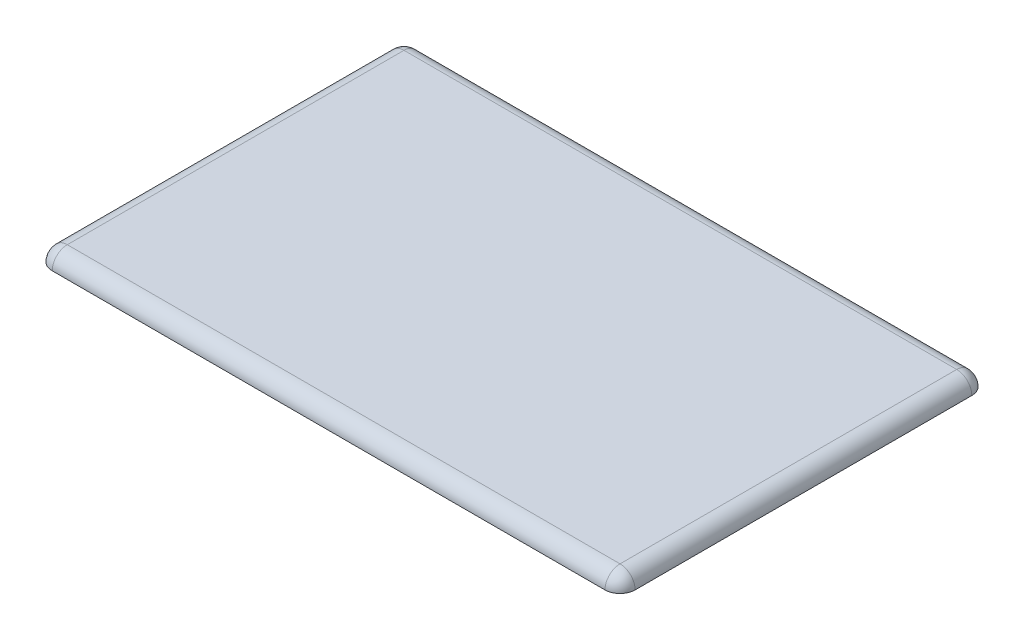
ISO-10303-21;
HEADER;
FILE_DESCRIPTION(('STEP AP214'),'2;1');
FILE_NAME('part.step','',(''),(''),'','','');
FILE_SCHEMA(('AUTOMOTIVE_DESIGN { 1 0 10303 214 1 1 1 1 }'));
ENDSEC;
DATA;
#1=APPLICATION_CONTEXT('core data for automotive mechanical design processes');
#2=APPLICATION_PROTOCOL_DEFINITION('international standard','automotive_design',2000,#1);
#3=PRODUCT_CONTEXT('',#1,'mechanical');
#4=PRODUCT('Part','Part','',(#3));
#5=PRODUCT_RELATED_PRODUCT_CATEGORY('part','',(#4));
#6=PRODUCT_DEFINITION_FORMATION('','',#4);
#7=PRODUCT_DEFINITION_CONTEXT('part definition',#1,'design');
#8=PRODUCT_DEFINITION('design','',#6,#7);
#9=PRODUCT_DEFINITION_SHAPE('','',#8);
#10=(LENGTH_UNIT() NAMED_UNIT(*) SI_UNIT(.MILLI.,.METRE.));
#11=(NAMED_UNIT(*) PLANE_ANGLE_UNIT() SI_UNIT($,.RADIAN.));
#12=(NAMED_UNIT(*) SI_UNIT($,.STERADIAN.) SOLID_ANGLE_UNIT());
#13=UNCERTAINTY_MEASURE_WITH_UNIT(LENGTH_MEASURE(1.E-05),#10,'distance_accuracy_value','');
#14=(GEOMETRIC_REPRESENTATION_CONTEXT(3) GLOBAL_UNCERTAINTY_ASSIGNED_CONTEXT((#13)) GLOBAL_UNIT_ASSIGNED_CONTEXT((#10,
#11,#12)) REPRESENTATION_CONTEXT('',''));
#15=CARTESIAN_POINT('',(0.,0.,0.));
#16=DIRECTION('',(0.,0.,1.));
#17=DIRECTION('',(1.,0.,0.));
#18=AXIS2_PLACEMENT_3D('',#15,#16,#17);
#19=CARTESIAN_POINT('',(55.,0.,-33.5));
#20=DIRECTION('',(0.,0.,1.));
#21=DIRECTION('',(1.,0.,0.));
#22=AXIS2_PLACEMENT_3D('',#19,#20,#21);
#23=SPHERICAL_SURFACE('',#22,3.);
#24=CARTESIAN_POINT('',(55.,0.,-33.5));
#25=DIRECTION('',(0.,0.,1.));
#26=DIRECTION('',(1.,0.,0.));
#27=AXIS2_PLACEMENT_3D('',#24,#25,#26);
#28=CIRCLE('',#27,3.);
#29=CARTESIAN_POINT('',(58.,0.,-33.5));
#30=VERTEX_POINT('',#29);
#31=CARTESIAN_POINT('',(55.,3.,-33.5));
#32=VERTEX_POINT('',#31);
#33=EDGE_CURVE('E139',#30,#32,#28,.T.);
#34=ORIENTED_EDGE('',*,*,#33,.F.);
#35=CARTESIAN_POINT('',(55.,0.,-33.5));
#36=DIRECTION('',(0.,-1.,0.));
#37=DIRECTION('',(0.,0.,-1.));
#38=AXIS2_PLACEMENT_3D('',#35,#36,#37);
#39=CIRCLE('',#38,3.);
#40=CARTESIAN_POINT('',(55.,0.,-36.5));
#41=VERTEX_POINT('',#40);
#42=EDGE_CURVE('E11',#41,#30,#39,.T.);
#43=ORIENTED_EDGE('',*,*,#42,.F.);
#44=CARTESIAN_POINT('',(55.,0.,-33.5));
#45=DIRECTION('',(1.,0.,0.));
#46=DIRECTION('',(0.,0.,-1.));
#47=AXIS2_PLACEMENT_3D('',#44,#45,#46);
#48=CIRCLE('',#47,3.);
#49=EDGE_CURVE('E40',#32,#41,#48,.F.);
#50=ORIENTED_EDGE('',*,*,#49,.F.);
#51=EDGE_LOOP('',(#34,#43,#50));
#52=FACE_BOUND('',#51,.T.);
#53=ADVANCED_FACE('F33',(#52),#23,.T.);
#54=CARTESIAN_POINT('',(-55.,0.,-33.5));
#55=DIRECTION('',(0.,0.,1.));
#56=DIRECTION('',(1.,0.,0.));
#57=AXIS2_PLACEMENT_3D('',#54,#55,#56);
#58=SPHERICAL_SURFACE('',#57,3.);
#59=CARTESIAN_POINT('',(-55.,0.,-33.5));
#60=DIRECTION('',(1.,0.,0.));
#61=DIRECTION('',(0.,0.,-1.));
#62=AXIS2_PLACEMENT_3D('',#59,#60,#61);
#63=CIRCLE('',#62,3.);
#64=CARTESIAN_POINT('',(-55.,0.,-36.5));
#65=VERTEX_POINT('',#64);
#66=CARTESIAN_POINT('',(-55.,3.,-33.5));
#67=VERTEX_POINT('',#66);
#68=EDGE_CURVE('E85',#65,#67,#63,.T.);
#69=ORIENTED_EDGE('',*,*,#68,.F.);
#70=CARTESIAN_POINT('',(-55.,0.,-33.5));
#71=DIRECTION('',(0.,-1.,0.));
#72=DIRECTION('',(0.,0.,-1.));
#73=AXIS2_PLACEMENT_3D('',#70,#71,#72);
#74=CIRCLE('',#73,3.);
#75=CARTESIAN_POINT('',(-58.,0.,-33.5));
#76=VERTEX_POINT('',#75);
#77=EDGE_CURVE('E87',#76,#65,#74,.T.);
#78=ORIENTED_EDGE('',*,*,#77,.F.);
#79=CARTESIAN_POINT('',(-55.,0.,-33.5));
#80=DIRECTION('',(0.,0.,-1.));
#81=DIRECTION('',(-1.,0.,0.));
#82=AXIS2_PLACEMENT_3D('',#79,#80,#81);
#83=CIRCLE('',#82,3.);
#84=EDGE_CURVE('E82',#67,#76,#83,.F.);
#85=ORIENTED_EDGE('',*,*,#84,.F.);
#86=EDGE_LOOP('',(#69,#78,#85));
#87=FACE_BOUND('',#86,.T.);
#88=ADVANCED_FACE('F84',(#87),#58,.T.);
#89=CARTESIAN_POINT('',(55.,0.,33.5));
#90=DIRECTION('',(0.,0.,1.));
#91=DIRECTION('',(1.,0.,0.));
#92=AXIS2_PLACEMENT_3D('',#89,#90,#91);
#93=SPHERICAL_SURFACE('',#92,3.);
#94=CARTESIAN_POINT('',(55.,0.,33.5));
#95=DIRECTION('',(-1.,0.,0.));
#96=DIRECTION('',(0.,0.,1.));
#97=AXIS2_PLACEMENT_3D('',#94,#95,#96);
#98=CIRCLE('',#97,3.);
#99=CARTESIAN_POINT('',(55.,0.,36.5));
#100=VERTEX_POINT('',#99);
#101=CARTESIAN_POINT('',(55.,3.,33.5));
#102=VERTEX_POINT('',#101);
#103=EDGE_CURVE('E131',#100,#102,#98,.T.);
#104=ORIENTED_EDGE('',*,*,#103,.F.);
#105=CARTESIAN_POINT('',(55.,0.,33.5));
#106=DIRECTION('',(0.,-1.,0.));
#107=DIRECTION('',(0.,0.,-1.));
#108=AXIS2_PLACEMENT_3D('',#105,#106,#107);
#109=CIRCLE('',#108,3.);
#110=CARTESIAN_POINT('',(58.,0.,33.5));
#111=VERTEX_POINT('',#110);
#112=EDGE_CURVE('E99',#111,#100,#109,.T.);
#113=ORIENTED_EDGE('',*,*,#112,.F.);
#114=CARTESIAN_POINT('',(55.,0.,33.5));
#115=DIRECTION('',(0.,0.,1.));
#116=DIRECTION('',(1.,0.,0.));
#117=AXIS2_PLACEMENT_3D('',#114,#115,#116);
#118=CIRCLE('',#117,3.);
#119=EDGE_CURVE('E134',#102,#111,#118,.F.);
#120=ORIENTED_EDGE('',*,*,#119,.F.);
#121=EDGE_LOOP('',(#104,#113,#120));
#122=FACE_BOUND('',#121,.T.);
#123=ADVANCED_FACE('F151',(#122),#93,.T.);
#124=CARTESIAN_POINT('',(-55.,0.,33.5));
#125=DIRECTION('',(0.,0.,1.));
#126=DIRECTION('',(1.,0.,0.));
#127=AXIS2_PLACEMENT_3D('',#124,#125,#126);
#128=SPHERICAL_SURFACE('',#127,3.);
#129=CARTESIAN_POINT('',(-55.,0.,33.5));
#130=DIRECTION('',(0.,0.,-1.));
#131=DIRECTION('',(-1.,0.,0.));
#132=AXIS2_PLACEMENT_3D('',#129,#130,#131);
#133=CIRCLE('',#132,3.);
#134=CARTESIAN_POINT('',(-58.,0.,33.5));
#135=VERTEX_POINT('',#134);
#136=CARTESIAN_POINT('',(-55.,3.,33.5));
#137=VERTEX_POINT('',#136);
#138=EDGE_CURVE('E108',#135,#137,#133,.T.);
#139=ORIENTED_EDGE('',*,*,#138,.F.);
#140=CARTESIAN_POINT('',(-55.,0.,33.5));
#141=DIRECTION('',(0.,-1.,0.));
#142=DIRECTION('',(0.,0.,-1.));
#143=AXIS2_PLACEMENT_3D('',#140,#141,#142);
#144=CIRCLE('',#143,3.);
#145=CARTESIAN_POINT('',(-55.,0.,36.5));
#146=VERTEX_POINT('',#145);
#147=EDGE_CURVE('E128',#146,#135,#144,.T.);
#148=ORIENTED_EDGE('',*,*,#147,.F.);
#149=CARTESIAN_POINT('',(-55.,0.,33.5));
#150=DIRECTION('',(-1.,0.,0.));
#151=DIRECTION('',(0.,0.,1.));
#152=AXIS2_PLACEMENT_3D('',#149,#150,#151);
#153=CIRCLE('',#152,3.);
#154=EDGE_CURVE('E125',#137,#146,#153,.F.);
#155=ORIENTED_EDGE('',*,*,#154,.F.);
#156=EDGE_LOOP('',(#139,#148,#155));
#157=FACE_BOUND('',#156,.T.);
#158=ADVANCED_FACE('F155',(#157),#128,.T.);
#159=CARTESIAN_POINT('',(-55.,0.,36.5));
#160=DIRECTION('',(0.,0.,-1.));
#161=DIRECTION('',(-1.,0.,0.));
#162=AXIS2_PLACEMENT_3D('',#159,#160,#161);
#163=CYLINDRICAL_SURFACE('',#162,3.);
#164=DIRECTION('',(0.,0.,-1.));
#165=VECTOR('',#164,1.);
#166=CARTESIAN_POINT('',(-55.,3.,0.));
#167=LINE('',#166,#165);
#168=EDGE_CURVE('E105',#67,#137,#167,.F.);
#169=ORIENTED_EDGE('',*,*,#168,.F.);
#170=ORIENTED_EDGE('',*,*,#84,.T.);
#171=DIRECTION('',(0.,0.,1.));
#172=VECTOR('',#171,1.);
#173=CARTESIAN_POINT('',(-58.,0.,36.5));
#174=LINE('',#173,#172);
#175=EDGE_CURVE('E119',#76,#135,#174,.T.);
#176=ORIENTED_EDGE('',*,*,#175,.T.);
#177=ORIENTED_EDGE('',*,*,#138,.T.);
#178=EDGE_LOOP('',(#169,#170,#176,#177));
#179=FACE_BOUND('',#178,.T.);
#180=ADVANCED_FACE('F111',(#179),#163,.T.);
#181=CARTESIAN_POINT('',(-58.,0.,33.5));
#182=DIRECTION('',(-1.,0.,0.));
#183=DIRECTION('',(0.,0.,1.));
#184=AXIS2_PLACEMENT_3D('',#181,#182,#183);
#185=CYLINDRICAL_SURFACE('',#184,3.);
#186=DIRECTION('',(1.,0.,0.));
#187=VECTOR('',#186,1.);
#188=CARTESIAN_POINT('',(-58.,0.,36.5));
#189=LINE('',#188,#187);
#190=EDGE_CURVE('E115',#146,#100,#189,.T.);
#191=ORIENTED_EDGE('',*,*,#190,.T.);
#192=ORIENTED_EDGE('',*,*,#103,.T.);
#193=DIRECTION('',(-1.,0.,0.));
#194=VECTOR('',#193,1.);
#195=CARTESIAN_POINT('',(0.,3.,33.5));
#196=LINE('',#195,#194);
#197=EDGE_CURVE('E114',#137,#102,#196,.F.);
#198=ORIENTED_EDGE('',*,*,#197,.F.);
#199=ORIENTED_EDGE('',*,*,#154,.T.);
#200=EDGE_LOOP('',(#191,#192,#198,#199));
#201=FACE_BOUND('',#200,.T.);
#202=ADVANCED_FACE('F153',(#201),#185,.T.);
#203=CARTESIAN_POINT('',(55.,0.,36.5));
#204=DIRECTION('',(0.,0.,1.));
#205=DIRECTION('',(1.,0.,0.));
#206=AXIS2_PLACEMENT_3D('',#203,#204,#205);
#207=CYLINDRICAL_SURFACE('',#206,3.);
#208=DIRECTION('',(0.,0.,-1.));
#209=VECTOR('',#208,1.);
#210=CARTESIAN_POINT('',(58.,0.,36.5));
#211=LINE('',#210,#209);
#212=EDGE_CURVE('E142',#111,#30,#211,.T.);
#213=ORIENTED_EDGE('',*,*,#212,.T.);
#214=ORIENTED_EDGE('',*,*,#33,.T.);
#215=DIRECTION('',(0.,0.,1.));
#216=VECTOR('',#215,1.);
#217=CARTESIAN_POINT('',(55.,3.,0.));
#218=LINE('',#217,#216);
#219=EDGE_CURVE('E107',#102,#32,#218,.F.);
#220=ORIENTED_EDGE('',*,*,#219,.F.);
#221=ORIENTED_EDGE('',*,*,#119,.T.);
#222=EDGE_LOOP('',(#213,#214,#220,#221));
#223=FACE_BOUND('',#222,.T.);
#224=ADVANCED_FACE('F147',(#223),#207,.T.);
#225=CARTESIAN_POINT('',(-58.,0.,-33.5));
#226=DIRECTION('',(1.,0.,0.));
#227=DIRECTION('',(0.,0.,-1.));
#228=AXIS2_PLACEMENT_3D('',#225,#226,#227);
#229=CYLINDRICAL_SURFACE('',#228,3.);
#230=DIRECTION('',(1.,0.,0.));
#231=VECTOR('',#230,1.);
#232=CARTESIAN_POINT('',(0.,3.,-33.5));
#233=LINE('',#232,#231);
#234=EDGE_CURVE('E96',#32,#67,#233,.F.);
#235=ORIENTED_EDGE('',*,*,#234,.F.);
#236=ORIENTED_EDGE('',*,*,#49,.T.);
#237=DIRECTION('',(-1.,0.,0.));
#238=VECTOR('',#237,1.);
#239=CARTESIAN_POINT('',(-58.,0.,-36.5));
#240=LINE('',#239,#238);
#241=EDGE_CURVE('E98',#41,#65,#240,.T.);
#242=ORIENTED_EDGE('',*,*,#241,.T.);
#243=ORIENTED_EDGE('',*,*,#68,.T.);
#244=EDGE_LOOP('',(#235,#236,#242,#243));
#245=FACE_BOUND('',#244,.T.);
#246=ADVANCED_FACE('F95',(#245),#229,.T.);
#247=CARTESIAN_POINT('',(0.,3.,0.));
#248=DIRECTION('',(0.,-1.,0.));
#249=DIRECTION('',(0.,0.,-1.));
#250=AXIS2_PLACEMENT_3D('',#247,#248,#249);
#251=PLANE('',#250);
#252=ORIENTED_EDGE('',*,*,#219,.T.);
#253=ORIENTED_EDGE('',*,*,#234,.T.);
#254=ORIENTED_EDGE('',*,*,#168,.T.);
#255=ORIENTED_EDGE('',*,*,#197,.T.);
#256=EDGE_LOOP('',(#252,#253,#254,#255));
#257=FACE_BOUND('',#256,.T.);
#258=ADVANCED_FACE('F103',(#257),#251,.F.);
#259=CARTESIAN_POINT('',(0.,0.,0.));
#260=DIRECTION('',(0.,-1.,0.));
#261=DIRECTION('',(0.,0.,-1.));
#262=AXIS2_PLACEMENT_3D('',#259,#260,#261);
#263=PLANE('',#262);
#264=ORIENTED_EDGE('',*,*,#241,.F.);
#265=ORIENTED_EDGE('',*,*,#42,.T.);
#266=ORIENTED_EDGE('',*,*,#212,.F.);
#267=ORIENTED_EDGE('',*,*,#112,.T.);
#268=ORIENTED_EDGE('',*,*,#190,.F.);
#269=ORIENTED_EDGE('',*,*,#147,.T.);
#270=ORIENTED_EDGE('',*,*,#175,.F.);
#271=ORIENTED_EDGE('',*,*,#77,.T.);
#272=EDGE_LOOP('',(#264,#265,#266,#267,#268,#269,#270,#271));
#273=FACE_BOUND('',#272,.T.);
#274=ADVANCED_FACE('F141',(#273),#263,.T.);
#275=CLOSED_SHELL('',(#53,#88,#123,#158,#180,#202,#224,#246,#258,#274));
#276=MANIFOLD_SOLID_BREP('B2',#275);
#277=ADVANCED_BREP_SHAPE_REPRESENTATION('',(#18,#276),#14);
#278=SHAPE_DEFINITION_REPRESENTATION(#9,#277);
ENDSEC;
END-ISO-10303-21;
